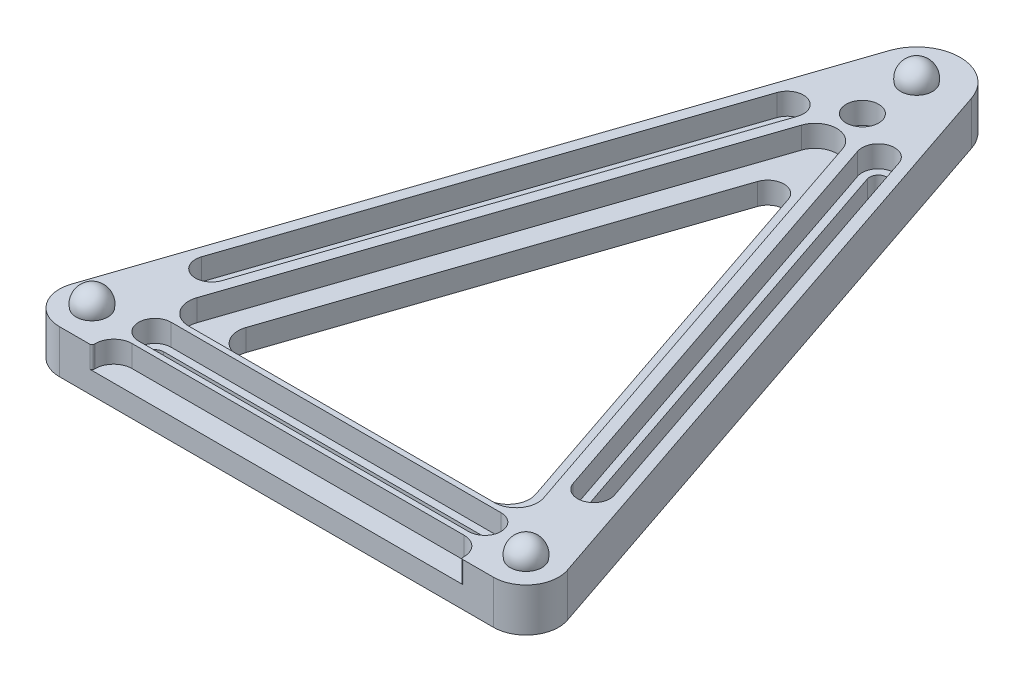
from build123d import *
from OCP.BRepFilletAPI import BRepFilletAPI_MakeFillet

# Parameters (mm, degrees)
EXTRUDE1_DEPTH     = 25.4
CUT_EXTRUDE1_DEPTH = 409.823632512
CUT_EXTRUDE2_DEPTH = 12.7
SKETCH10_W         = 215.9
SKETCH10_H         = 12.7
CUT_EXTRUDE3_DEPTH = 12.7
FILLET1_R1         = 10.795
FILLET1_R2         = 1.27
CUT_EXTRUDE4_DEPTH = 409.823632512
CUT_EXTRUDE5_DEPTH = 12.7
CUT_EXTRUDE6_DEPTH = 409.823632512
CUT_EXTRUDE7_DEPTH = 12.7


with BuildPart() as part:
    # Sketch3 → Revolve1 (revolve)
    with BuildSketch(Plane(origin=(0, 0, 0), x_dir=(0, 0, -1), z_dir=(1, 0, 0))):
        with BuildLine():
            Line((355.6, 0), (355.6, -19.05))
            ThreePointArc((355.6, -19.05), (365.125, -9.525), (355.6, 0))
        make_face()
    revolve1 = revolve(axis=Axis((0, 21.371055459, -355.6), (0, -1, 0)))

    # Sketch5 → Extrude1 (add)
    with BuildSketch(Plane(origin=(0, -11.43, 0), x_dir=(-1, 0, 0), z_dir=(0, 1, 0))):
        with BuildLine():
            Line((127, 19.05), (-127, 19.05))
            ThreePointArc((-127, 19.05), (-142.478941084, 11.104273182), (-145.045395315, -6.10460547))
            Line((-145.045395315, -6.10460547), (-24.060527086, -363.739473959))
            ThreePointArc((-24.060527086, -363.739473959), (0, -381), (24.060527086, -363.739473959))
            Line((24.060527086, -363.739473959), (145.045395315, -6.10460547))
            ThreePointArc((145.045395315, -6.10460547), (142.478941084, 11.104273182), (127, 19.05))
        make_face()
    extrude(amount=-EXTRUDE1_DEPTH)

    # Sketch-Pattern1: Revolve1 at 2 more places
    with Locations((-127, 0, 355.6), (127, 0, 355.6)):
        add(revolve1)

    # Sketch6 → Cut-Revolve1 (revolve, cut)
    with BuildSketch(Plane(origin=(0, 0, 0), x_dir=(0, 0, -1), z_dir=(1, 0, 0))):
        Polygon((323.85, -11.43), (323.85, -36.83), (329.057, -36.83), (329.057, -24.13), (333.375, -24.13), (333.375, -11.43), align=None)
    revolve(axis=Axis((0, -11.43, -323.85), (0, 1, 0)), mode=Mode.SUBTRACT)

    # Sketch8 → Cut-Extrude1 (cut, through all)
    with BuildSketch(Plane(origin=(0, -11.43, 0), x_dir=(-1, 0, 0), z_dir=(0, 1, 0))):
        with BuildLine():
            Line((-116.603830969, -56.491894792), (-31.479588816, -308.12168613))
            ThreePointArc((-31.479588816, -308.12168613), (-25.039588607, -311.305896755), (-21.855377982, -304.865896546))
            Line((-21.855377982, -304.865896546), (-106.979620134, -53.236105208))
            ThreePointArc((-106.979620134, -53.236105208), (-113.419620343, -50.051894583), (-116.603830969, -56.491894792))
        make_face()
    cut_extrude1 = extrude(amount=-CUT_EXTRUDE1_DEPTH, mode=Mode.SUBTRACT)

    # Sketch9 → Cut-Extrude2 (cut)
    with BuildSketch(Plane(origin=(0, -11.43, 0), x_dir=(-1, 0, 0), z_dir=(0, 1, 0))):
        with BuildLine():
            Line((-120.814423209, -57.916302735), (-35.690181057, -309.546094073))
            ThreePointArc((-35.690181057, -309.546094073), (-23.615180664, -315.516488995), (-17.644785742, -303.441488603))
            Line((-17.644785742, -303.441488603), (-102.769027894, -51.811697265))
            ThreePointArc((-102.769027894, -51.811697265), (-114.844028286, -45.841302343), (-120.814423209, -57.916302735))
        make_face()
    cut_extrude2 = extrude(amount=-CUT_EXTRUDE2_DEPTH, mode=Mode.SUBTRACT)

    # Mirror1: Cut-Extrude1, Cut-Extrude2 across plane
    add(cut_extrude1.mirror(Plane(origin=(0, 0, 0), x_dir=(0, 0, 1), z_dir=(1, 0, 0))), mode=Mode.SUBTRACT)
    add(cut_extrude2.mirror(Plane(origin=(0, 0, 0), x_dir=(0, 0, 1), z_dir=(1, 0, 0))), mode=Mode.SUBTRACT)

    # Sketch10 → Cut-Extrude3 (cut)
    with BuildSketch(Plane(origin=(0, -11.43, 0), x_dir=(-1, 0, 0), z_dir=(0, 1, 0))):
        with Locations((0, 12.7)):
            Rectangle(SKETCH10_W, SKETCH10_H)
    extrude(amount=-CUT_EXTRUDE3_DEPTH, mode=Mode.SUBTRACT)

    # Fillet1: one fillet with a radius per group of edges: ONE call of the kernel's fillet builder (fillet() takes one radius for all edges)
    fillet1_edges_1 = [part.edges().sort_by_distance(p)[0] for p in [
        (107.95, -17.78, 6.35),
        (-107.95, -17.78, 6.35),
    ]]
    fillet1_edges_2 = [part.edges().sort_by_distance(p)[0] for p in [
        (107.95, -17.78, 19.05),
        (-107.95, -17.78, 19.05),
    ]]
    fillet1 = BRepFilletAPI_MakeFillet(part.part.solid().wrapped)
    for e in fillet1_edges_1:
        fillet1.Add(FILLET1_R1, e.wrapped)
    for e in fillet1_edges_2:
        fillet1.Add(FILLET1_R2, e.wrapped)
    add(Compound.cast(fillet1.Shape()), mode=Mode.REPLACE)

    # Sketch11 → Cut-Extrude4 (cut, through all)
    with BuildSketch(Plane(origin=(0, -11.43, 0), x_dir=(-1, 0, 0), z_dir=(0, 1, 0))):
        with BuildLine():
            Line((-96.52, -1.27), (96.52, -1.27))
            ThreePointArc((96.52, -1.27), (101.6, -6.35), (96.52, -11.43))
            Line((96.52, -11.43), (-96.52, -11.43))
            ThreePointArc((-96.52, -11.43), (-101.6, -6.35), (-96.52, -1.27))
        make_face()
    extrude(amount=-CUT_EXTRUDE4_DEPTH, mode=Mode.SUBTRACT)

    # Sketch12 → Cut-Extrude5 (cut)
    with BuildSketch(Plane(origin=(0, -11.43, 0), x_dir=(-1, 0, 0), z_dir=(0, 1, 0))):
        with BuildLine():
            Line((96.52, 3.175), (-96.52, 3.175))
            ThreePointArc((-96.52, 3.175), (-106.045, -6.35), (-96.52, -15.875))
            Line((-96.52, -15.875), (96.52, -15.875))
            ThreePointArc((96.52, -15.875), (106.045, -6.35), (96.52, 3.175))
        make_face()
    extrude(amount=-CUT_EXTRUDE5_DEPTH, mode=Mode.SUBTRACT)

    # Sketch13 → Cut-Extrude6 (cut, through all)
    with BuildSketch(Plane(origin=(0, -11.43, 0), x_dir=(-1, 0, 0), z_dir=(0, 1, 0))):
        with BuildLine():
            Line((-72.627041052, -31.115), (72.627041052, -31.115))
            ThreePointArc((72.627041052, -31.115), (82.946335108, -36.412151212), (84.657304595, -47.88473698))
            Line((84.657304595, -47.88473698), (9.022697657, -271.462884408))
            ThreePointArc((9.022697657, -271.462884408), (0, -277.935581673), (-9.022697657, -271.462884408))
            Line((-9.022697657, -271.462884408), (-84.657304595, -47.88473698))
            ThreePointArc((-84.657304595, -47.88473698), (-82.946335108, -36.412151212), (-72.627041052, -31.115))
        make_face()
    extrude(amount=-CUT_EXTRUDE6_DEPTH, mode=Mode.SUBTRACT)

    # Sketch14 → Cut-Extrude7 (cut)
    with BuildSketch(Plane(origin=(0, -11.43, 0), x_dir=(-1, 0, 0), z_dir=(0, 1, 0))):
        with BuildLine():
            Line((12.030263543, -300.222406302), (101.475462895, -35.81973698))
            ThreePointArc((101.475462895, -35.81973698), (99.764493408, -24.347151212), (89.445199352, -19.05))
            Line((89.445199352, -19.05), (-89.445199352, -19.05))
            ThreePointArc((-89.445199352, -19.05), (-99.764493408, -24.347151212), (-101.475462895, -35.81973698))
            Line((-101.475462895, -35.81973698), (-12.030263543, -300.222406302))
            ThreePointArc((-12.030263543, -300.222406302), (0, -308.852669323), (12.030263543, -300.222406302))
        make_face()
    extrude(amount=-CUT_EXTRUDE7_DEPTH, mode=Mode.SUBTRACT)


solid = part.part
